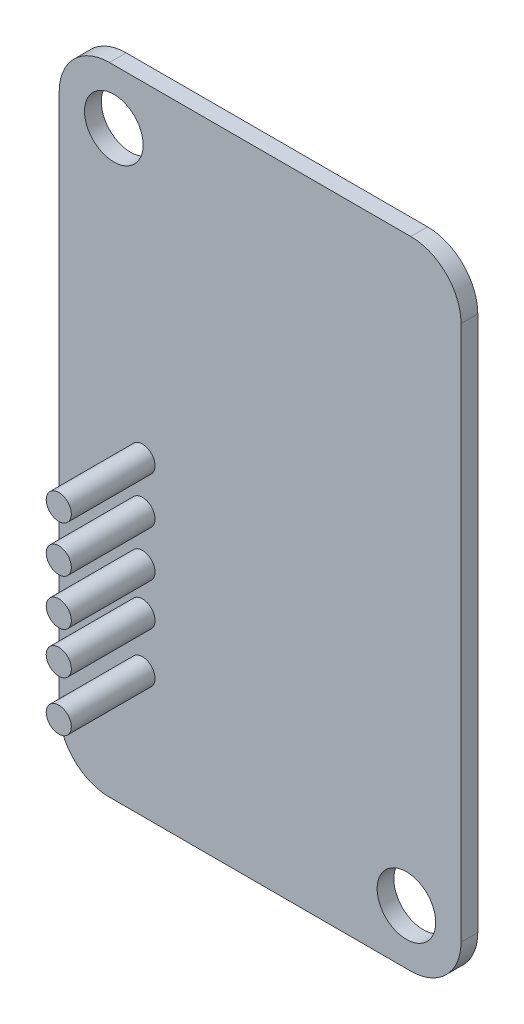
from build123d import *

# Parameters (mm, degrees)
ESQUISSE1_W             = 24
ESQUISSE1_H             = 38
BOSS_EXTRU_1_DEPTH      = 1
CONG_1_R                = 3
ESQUISSE2_W             = 4
ESQUISSE2_H             = 3
ESQUISSE2_W_2           = 3
ESQUISSE2_H_2           = 4
BOSS_EXTRU_2_DEPTH      = 2
ESQUISSE3_R             = 1.75
ENL_V_MAT_EXTRU_1_DEPTH = 25.269322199
BOSS_EXTRU_3_DEPTH      = 2
BOSS_EXTRU_3_DEPTH_BACK = 6
ESQUISSE4_R             = 0.75


with BuildPart() as part:
    # Esquisse1 → Boss.-Extru.1 (new body)
    with BuildSketch(Plane.XY):
        with Locations((0, -2)):
            Rectangle(ESQUISSE1_W, ESQUISSE1_H)
    extrude(amount=BOSS_EXTRU_1_DEPTH)

    # Cong_1
    cong_1_edges = [part.edges().sort_by_distance(p)[0] for p in [
        (12, 17, 0.5),
        (12, -21, 0.5),
        (-12, -21, 0.5),
        (-12, 17, 0.5),
    ]]
    fillet(cong_1_edges, radius=CONG_1_R)

    # Esquisse2 → Boss.-Extru.2 (add)
    with BuildSketch(Plane(origin=(0, 0, 0), x_dir=(-1, 0, 0), z_dir=(0, 0, -1))):
        with Locations((5, 0)):
            Rectangle(ESQUISSE2_W, ESQUISSE2_H)
        with Locations((0, 5)):
            Rectangle(ESQUISSE2_W_2, ESQUISSE2_H_2)
        with Locations((-5, 0)):
            Rectangle(ESQUISSE2_W, ESQUISSE2_H)
        with Locations((0, -5)):
            Rectangle(ESQUISSE2_W_2, ESQUISSE2_H_2)
    extrude(amount=BOSS_EXTRU_2_DEPTH)

    # Esquisse3 → Enl_v. mat.-Extru.1 (cut, through all)
    with BuildSketch(Plane(origin=(0, 0, 0), x_dir=(-1, 0, 0), z_dir=(0, 0, -1))):
        with Locations((8.737238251, 13.737238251)):
            Circle(ESQUISSE3_R)
        with Locations((-8.737238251, -17.737238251)):
            Circle(ESQUISSE3_R)
    extrude(amount=-ENL_V_MAT_EXTRU_1_DEPTH, mode=Mode.SUBTRACT)

    # Esquisse4 → Boss.-Extru.3 (add, two sides: drawn at the far end of the back side and taken through both)
    with BuildSketch(Plane(origin=(0, 0, 0), x_dir=(-1, 0, 0), z_dir=(0, 0, -1)).offset(-BOSS_EXTRU_3_DEPTH_BACK)):
        with Locations((7.025730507, -2.5)):
            Circle(ESQUISSE4_R)
        with Locations((7.025730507, -5.255665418)):
            Circle(ESQUISSE4_R)
        with Locations((7.025730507, -8)):
            Circle(ESQUISSE4_R)
        with Locations((7.025730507, -10.507805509)):
            Circle(ESQUISSE4_R)
        with Locations((7.025730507, -13.5)):
            Circle(ESQUISSE4_R)
    extrude(amount=BOSS_EXTRU_3_DEPTH + BOSS_EXTRU_3_DEPTH_BACK)


solid = part.part
